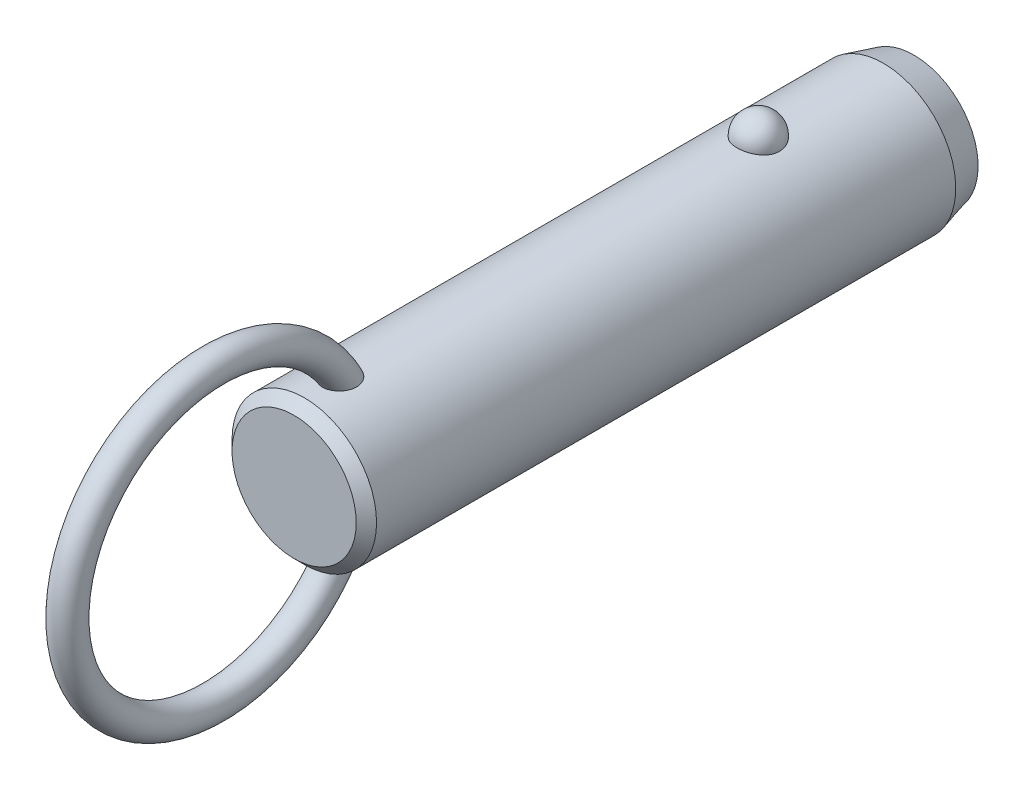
ISO-10303-21;
HEADER;
FILE_DESCRIPTION(('STEP AP214'),'2;1');
FILE_NAME('part.step','',(''),(''),'','','');
FILE_SCHEMA(('AUTOMOTIVE_DESIGN { 1 0 10303 214 1 1 1 1 }'));
ENDSEC;
DATA;
#1=APPLICATION_CONTEXT('core data for automotive mechanical design processes');
#2=APPLICATION_PROTOCOL_DEFINITION('international standard','automotive_design',2000,#1);
#3=PRODUCT_CONTEXT('',#1,'mechanical');
#4=PRODUCT('Part','Part','',(#3));
#5=PRODUCT_RELATED_PRODUCT_CATEGORY('part','',(#4));
#6=PRODUCT_DEFINITION_FORMATION('','',#4);
#7=PRODUCT_DEFINITION_CONTEXT('part definition',#1,'design');
#8=PRODUCT_DEFINITION('design','',#6,#7);
#9=PRODUCT_DEFINITION_SHAPE('','',#8);
#10=(LENGTH_UNIT() NAMED_UNIT(*) SI_UNIT(.MILLI.,.METRE.));
#11=(NAMED_UNIT(*) PLANE_ANGLE_UNIT() SI_UNIT($,.RADIAN.));
#12=(NAMED_UNIT(*) SI_UNIT($,.STERADIAN.) SOLID_ANGLE_UNIT());
#13=UNCERTAINTY_MEASURE_WITH_UNIT(LENGTH_MEASURE(1.E-05),#10,'distance_accuracy_value','');
#14=(GEOMETRIC_REPRESENTATION_CONTEXT(3) GLOBAL_UNCERTAINTY_ASSIGNED_CONTEXT((#13)) GLOBAL_UNIT_ASSIGNED_CONTEXT((#10,
#11,#12)) REPRESENTATION_CONTEXT('',''));
#15=CARTESIAN_POINT('',(0.,0.,0.));
#16=DIRECTION('',(0.,0.,1.));
#17=DIRECTION('',(1.,0.,0.));
#18=AXIS2_PLACEMENT_3D('',#15,#16,#17);
#19=CARTESIAN_POINT('',(0.,0.,35.6));
#20=DIRECTION('',(0.,0.,-1.));
#21=DIRECTION('',(-1.,0.,0.));
#22=AXIS2_PLACEMENT_3D('',#19,#20,#21);
#23=CYLINDRICAL_SURFACE('',#22,7.1);
#24=CARTESIAN_POINT('',(2.0769088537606,6.78943661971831,-2.1));
#25=CARTESIAN_POINT('',(2.07690739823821,6.78943796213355,-1.98268154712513));
#26=CARTESIAN_POINT('',(2.06738130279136,6.79237331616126,-1.86534506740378));
#27=CARTESIAN_POINT('',(2.0295040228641,6.8037853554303,-1.63400788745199));
#28=CARTESIAN_POINT('',(2.00114757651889,6.81226358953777,-1.52000812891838));
#29=CARTESIAN_POINT('',(1.92632025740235,6.83379798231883,-1.29863433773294));
#30=CARTESIAN_POINT('',(1.87985726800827,6.84685214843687,-1.19125744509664));
#31=CARTESIAN_POINT('',(1.76995205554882,6.87608091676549,-0.98604657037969));
#32=CARTESIAN_POINT('',(1.70650980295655,6.8922555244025,-0.88821260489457));
#33=CARTESIAN_POINT('',(1.5638119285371,6.92602930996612,-0.704242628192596));
#34=CARTESIAN_POINT('',(1.4844714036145,6.94363582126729,-0.618173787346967));
#35=CARTESIAN_POINT('',(1.31221746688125,6.97823658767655,-0.460740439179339));
#36=CARTESIAN_POINT('',(1.21930409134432,6.99523084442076,-0.389375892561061));
#37=CARTESIAN_POINT('',(1.02268781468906,7.02666176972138,-0.263547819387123));
#38=CARTESIAN_POINT('',(0.91902009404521,7.04110638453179,-0.209031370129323));
#39=CARTESIAN_POINT('',(0.703548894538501,7.06588726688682,-0.118163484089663));
#40=CARTESIAN_POINT('',(0.591746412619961,7.07622403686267,-0.0818098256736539));
#41=CARTESIAN_POINT('',(0.365557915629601,7.09147068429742,-0.0288711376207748));
#42=CARTESIAN_POINT('',(0.251267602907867,7.09648447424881,-0.0119070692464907));
#43=CARTESIAN_POINT('',(0.0213499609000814,7.10089837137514,0.00304925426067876));
#44=CARTESIAN_POINT('',(-0.0942772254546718,7.10029907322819,0.00104351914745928));
#45=CARTESIAN_POINT('',(-0.321651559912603,7.09360829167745,-0.0216931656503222));
#46=CARTESIAN_POINT('',(-0.433431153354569,7.08760388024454,-0.0421272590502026));
#47=CARTESIAN_POINT('',(-0.651862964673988,7.07086131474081,-0.100729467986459));
#48=CARTESIAN_POINT('',(-0.758515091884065,7.06012307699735,-0.138897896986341));
#49=CARTESIAN_POINT('',(-0.964449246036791,7.03496097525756,-0.232213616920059));
#50=CARTESIAN_POINT('',(-1.06368095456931,7.02051445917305,-0.287465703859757));
#51=CARTESIAN_POINT('',(-1.25145353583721,6.98948740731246,-0.413383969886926));
#52=CARTESIAN_POINT('',(-1.33999321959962,6.97290663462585,-0.48405186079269));
#53=CARTESIAN_POINT('',(-1.50591604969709,6.93898770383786,-0.640594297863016));
#54=CARTESIAN_POINT('',(-1.58302488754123,6.92164094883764,-0.726757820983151));
#55=CARTESIAN_POINT('',(-1.72189320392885,6.8884103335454,-0.91092752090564));
#56=CARTESIAN_POINT('',(-1.78365144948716,6.87252659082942,-1.008934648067));
#57=CARTESIAN_POINT('',(-1.89101272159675,6.84377189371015,-1.21549497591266));
#58=CARTESIAN_POINT('',(-1.93639553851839,6.83094274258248,-1.32416860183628));
#59=CARTESIAN_POINT('',(-2.00874275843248,6.81002070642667,-1.54791500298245));
#60=CARTESIAN_POINT('',(-2.03570774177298,6.80192767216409,-1.66298757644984));
#61=CARTESIAN_POINT('',(-2.07047276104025,6.7914266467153,-1.89571453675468));
#62=CARTESIAN_POINT('',(-2.07835878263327,6.78899315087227,-2.01335491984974));
#63=CARTESIAN_POINT('',(-2.07502083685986,6.79001409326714,-2.24833570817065));
#64=CARTESIAN_POINT('',(-2.06379746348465,6.7934683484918,-2.36567612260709));
#65=CARTESIAN_POINT('',(-2.02263913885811,6.80583442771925,-2.59603194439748));
#66=CARTESIAN_POINT('',(-1.99281127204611,6.81471501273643,-2.70906820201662));
#67=CARTESIAN_POINT('',(-1.91526639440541,6.83691232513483,-2.92836575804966));
#68=CARTESIAN_POINT('',(-1.8675486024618,6.85022924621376,-3.03462676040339));
#69=CARTESIAN_POINT('',(-1.75504492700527,6.87991336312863,-3.23806487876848));
#70=CARTESIAN_POINT('',(-1.69015924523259,6.89629822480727,-3.33518422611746));
#71=CARTESIAN_POINT('',(-1.54505404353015,6.93024852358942,-3.51697105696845));
#72=CARTESIAN_POINT('',(-1.46483385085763,6.94781401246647,-3.60163799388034));
#73=CARTESIAN_POINT('',(-1.29071406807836,6.98225977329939,-3.75654119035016));
#74=CARTESIAN_POINT('',(-1.19675650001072,6.99913673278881,-3.82671308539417));
#75=CARTESIAN_POINT('',(-0.997940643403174,7.03023618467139,-3.9501837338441));
#76=CARTESIAN_POINT('',(-0.89308318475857,7.04445887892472,-4.00348377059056));
#77=CARTESIAN_POINT('',(-0.676902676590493,7.06848365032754,-4.09107242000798));
#78=CARTESIAN_POINT('',(-0.565686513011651,7.0783430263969,-4.12560889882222));
#79=CARTESIAN_POINT('',(-0.338739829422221,7.09282534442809,-4.17575450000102));
#80=CARTESIAN_POINT('',(-0.223009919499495,7.09744899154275,-4.19136617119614));
#81=CARTESIAN_POINT('',(0.00707628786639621,7.10090930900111,-4.20307965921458));
#82=CARTESIAN_POINT('',(0.121410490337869,7.09986531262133,-4.19958377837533));
#83=CARTESIAN_POINT('',(0.347815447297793,7.092380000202,-4.17411564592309));
#84=CARTESIAN_POINT('',(0.459886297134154,7.08593891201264,-4.15214417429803));
#85=CARTESIAN_POINT('',(0.678084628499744,7.06838983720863,-4.09049562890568));
#86=CARTESIAN_POINT('',(0.784237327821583,7.05730369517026,-4.05090137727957));
#87=CARTESIAN_POINT('',(0.988305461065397,7.03163139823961,-3.95511447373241));
#88=CARTESIAN_POINT('',(1.08622031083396,7.01704499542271,-3.89892064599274));
#89=CARTESIAN_POINT('',(1.27284490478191,6.98562668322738,-3.77035541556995));
#90=CARTESIAN_POINT('',(1.36137372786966,6.96876135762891,-3.69772964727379));
#91=CARTESIAN_POINT('',(1.52509486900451,6.93477412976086,-3.53878279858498));
#92=CARTESIAN_POINT('',(1.60028496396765,6.91765218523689,-3.45245943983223));
#93=CARTESIAN_POINT('',(1.73681688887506,6.88465753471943,-3.26658774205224));
#94=CARTESIAN_POINT('',(1.79785966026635,6.86881574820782,-3.16681408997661));
#95=CARTESIAN_POINT('',(1.90265327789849,6.84053157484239,-2.95814408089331));
#96=CARTESIAN_POINT('',(1.94640861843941,6.82808830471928,-2.84925010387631));
#97=CARTESIAN_POINT('',(2.01274378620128,6.80881460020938,-2.63454318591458));
#98=CARTESIAN_POINT('',(2.03676193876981,6.80160856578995,-2.52920574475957));
#99=CARTESIAN_POINT('',(2.06884490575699,6.79191902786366,-2.3159172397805));
#100=CARTESIAN_POINT('',(2.07691019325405,6.78943538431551,-2.20796625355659));
#101=CARTESIAN_POINT('',(2.0769088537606,6.78943661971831,-2.1));
#102=B_SPLINE_CURVE_WITH_KNOTS('',3,(#24,#25,#26,#27,#28,#29,#30,#31,#32,#33,#34,#35,#36,#37,
#38,#39,#40,#41,#42,#43,#44,#45,#46,#47,#48,#49,#50,#51,#52,#53,#54,#55,#56,#57,#58,#59,#60,#61,
#62,#63,#64,#65,#66,#67,#68,#69,#70,#71,#72,#73,#74,#75,#76,#77,#78,#79,#80,#81,#82,#83,#84,#85,
#86,#87,#88,#89,#90,#91,#92,#93,#94,#95,#96,#97,#98,#99,#100,#101),.UNSPECIFIED.,.T.,.F.,(4,2,2,
2,2,2,2,2,2,2,2,2,2,2,2,2,2,2,2,2,2,2,2,2,2,2,2,2,2,2,2,2,2,2,2,2,2,2,4),(0.,0.351568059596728,
0.703234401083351,1.05474780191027,1.40626181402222,1.75970563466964,2.11314851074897,
2.4654696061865,2.81774759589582,3.16301449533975,3.50824481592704,3.84801136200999,
4.18778391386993,4.52968352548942,4.87162112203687,5.22076181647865,5.56993054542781,
5.92363364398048,6.27732559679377,6.62942052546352,6.98150450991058,7.33158042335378,
7.68167162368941,8.03384443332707,8.38603269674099,8.73975272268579,9.09344583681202,
9.44234545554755,9.79119807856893,10.1327344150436,10.4742563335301,10.8141898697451,
11.1541474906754,11.4997793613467,11.8454687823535,12.1979079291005,12.5502553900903,
12.8738073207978,13.1973496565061),.UNSPECIFIED.);
#103=CARTESIAN_POINT('',(2.0769088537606,6.78943661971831,-2.1));
#104=VERTEX_POINT('',#103);
#105=EDGE_CURVE('E41',#104,#104,#102,.T.);
#106=ORIENTED_EDGE('',*,*,#105,.T.);
#107=EDGE_LOOP('',(#106));
#108=FACE_BOUND('',#107,.T.);
#109=CARTESIAN_POINT('',(0.,0.,42.52));
#110=DIRECTION('',(0.,0.,1.));
#111=DIRECTION('',(1.,0.,0.));
#112=AXIS2_PLACEMENT_3D('',#109,#110,#111);
#113=CIRCLE('',#112,7.1);
#114=CARTESIAN_POINT('',(7.1,0.,42.52));
#115=VERTEX_POINT('',#114);
#116=EDGE_CURVE('E10',#115,#115,#113,.F.);
#117=ORIENTED_EDGE('',*,*,#116,.T.);
#118=EDGE_LOOP('',(#117));
#119=FACE_BOUND('',#118,.T.);
#120=CARTESIAN_POINT('',(-0.429539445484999,-7.08699541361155,37.3429212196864));
#121=CARTESIAN_POINT('',(-0.50833166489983,-7.08221999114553,37.3668764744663));
#122=CARTESIAN_POINT('',(-0.585039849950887,-7.07624016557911,37.3974570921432));
#123=CARTESIAN_POINT('',(-0.732082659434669,-7.06254296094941,37.4710242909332));
#124=CARTESIAN_POINT('',(-0.802417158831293,-7.05482554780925,37.5140111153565));
#125=CARTESIAN_POINT('',(-0.934722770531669,-7.03851844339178,37.6111135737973));
#126=CARTESIAN_POINT('',(-0.996700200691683,-7.02992941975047,37.6652207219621));
#127=CARTESIAN_POINT('',(-1.11079942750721,-7.01280697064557,37.7829676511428));
#128=CARTESIAN_POINT('',(-1.16292136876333,-7.00427354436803,37.8466072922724));
#129=CARTESIAN_POINT('',(-1.25705660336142,-6.98799959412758,37.9826870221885));
#130=CARTESIAN_POINT('',(-1.29888032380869,-6.98027525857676,38.0552598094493));
#131=CARTESIAN_POINT('',(-1.37069920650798,-6.96652886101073,38.2061686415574));
#132=CARTESIAN_POINT('',(-1.40069157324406,-6.96050720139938,38.2845060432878));
#133=CARTESIAN_POINT('',(-1.45043507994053,-6.95031881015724,38.4501903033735));
#134=CARTESIAN_POINT('',(-1.46937115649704,-6.94630231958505,38.5377897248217));
#135=CARTESIAN_POINT('',(-1.49424917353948,-6.94099239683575,38.7148714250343));
#136=CARTESIAN_POINT('',(-1.50018601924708,-6.93970003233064,38.8043544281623));
#137=CARTESIAN_POINT('',(-1.49978214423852,-6.93978815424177,38.9940607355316));
#138=CARTESIAN_POINT('',(-1.49187639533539,-6.94150934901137,39.094279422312));
#139=CARTESIAN_POINT('',(-1.46177925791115,-6.94790814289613,39.2924798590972));
#140=CARTESIAN_POINT('',(-1.43957541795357,-6.95258831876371,39.390459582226));
#141=CARTESIAN_POINT('',(-1.37783293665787,-6.96510647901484,39.5953629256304));
#142=CARTESIAN_POINT('',(-1.33634073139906,-6.97328848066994,39.7016801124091));
#143=CARTESIAN_POINT('',(-1.23686994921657,-6.99161706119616,39.9061777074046));
#144=CARTESIAN_POINT('',(-1.17889192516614,-7.00176357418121,40.0043583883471));
#145=CARTESIAN_POINT('',(-1.05875124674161,-7.02082898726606,40.172374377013));
#146=CARTESIAN_POINT('',(-0.999247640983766,-7.02963746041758,40.2441230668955));
#147=CARTESIAN_POINT('',(-0.869494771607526,-7.04686074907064,40.3771959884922));
#148=CARTESIAN_POINT('',(-0.799263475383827,-7.05527619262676,40.4385372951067));
#149=CARTESIAN_POINT('',(-0.665408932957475,-7.06899457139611,40.5351316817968));
#150=CARTESIAN_POINT('',(-0.603817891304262,-7.07457275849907,40.5731512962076));
#151=CARTESIAN_POINT('',(-0.475172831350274,-7.08437420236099,40.6387581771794));
#152=CARTESIAN_POINT('',(-0.408123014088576,-7.08859848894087,40.6663533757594));
#153=CARTESIAN_POINT('',(-0.269431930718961,-7.09522749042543,40.7092569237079));
#154=CARTESIAN_POINT('',(-0.197757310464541,-7.09761688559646,40.7244618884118));
#155=CARTESIAN_POINT('',(-0.052784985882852,-7.10017268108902,40.7407168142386));
#156=CARTESIAN_POINT('',(0.0205115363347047,-7.10034065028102,40.7417767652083));
#157=CARTESIAN_POINT('',(0.156426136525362,-7.09855986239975,40.7304619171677));
#158=CARTESIAN_POINT('',(0.219199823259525,-7.09688191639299,40.7198060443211));
#159=CARTESIAN_POINT('',(0.342134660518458,-7.09201880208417,40.6885379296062));
#160=CARTESIAN_POINT('',(0.402295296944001,-7.08883333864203,40.6679237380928));
#161=CARTESIAN_POINT('',(0.520687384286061,-7.08113868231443,40.6172125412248));
#162=CARTESIAN_POINT('',(0.57879126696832,-7.07658958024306,40.5868272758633));
#163=CARTESIAN_POINT('',(0.690173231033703,-7.06659708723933,40.5183678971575));
#164=CARTESIAN_POINT('',(0.743447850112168,-7.061153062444,40.4802883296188));
#165=CARTESIAN_POINT('',(0.870947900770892,-7.04680292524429,40.3765929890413));
#166=CARTESIAN_POINT('',(0.941828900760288,-7.0375580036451,40.3068972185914));
#167=CARTESIAN_POINT('',(1.07136606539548,-7.01900793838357,40.1569450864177));
#168=CARTESIAN_POINT('',(1.13000013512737,-7.00970271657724,40.0766700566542));
#169=CARTESIAN_POINT('',(1.23579584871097,-6.99183327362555,39.9068997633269));
#170=CARTESIAN_POINT('',(1.28274271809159,-6.98328455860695,39.8172696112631));
#171=CARTESIAN_POINT('',(1.36351442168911,-6.96796352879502,39.6321763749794));
#172=CARTESIAN_POINT('',(1.39733971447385,-6.96119115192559,39.5367134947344));
#173=CARTESIAN_POINT('',(1.45579181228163,-6.94922464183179,39.3253092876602));
#174=CARTESIAN_POINT('',(1.47790145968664,-6.94449000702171,39.208631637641));
#175=CARTESIAN_POINT('',(1.50168752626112,-6.93938731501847,38.9730153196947));
#176=CARTESIAN_POINT('',(1.50336085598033,-6.93901991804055,38.8540763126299));
#177=CARTESIAN_POINT('',(1.48486516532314,-6.9430010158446,38.6236079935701));
#178=CARTESIAN_POINT('',(1.46573441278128,-6.9471253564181,38.5119958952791));
#179=CARTESIAN_POINT('',(1.40606892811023,-6.95944667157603,38.2948868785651));
#180=CARTESIAN_POINT('',(1.3655644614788,-6.96763788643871,38.1893815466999));
#181=CARTESIAN_POINT('',(1.27082700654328,-6.98548038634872,38.0042879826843));
#182=CARTESIAN_POINT('',(1.21949810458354,-6.99473841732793,37.9231719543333));
#183=CARTESIAN_POINT('',(1.10242050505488,-7.01414069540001,37.7722278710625));
#184=CARTESIAN_POINT('',(1.03668119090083,-7.02428436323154,37.7023925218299));
#185=CARTESIAN_POINT('',(0.900559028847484,-7.04295285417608,37.5835735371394));
#186=CARTESIAN_POINT('',(0.831428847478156,-7.05153466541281,37.5331573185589));
#187=CARTESIAN_POINT('',(0.685291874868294,-7.06723150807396,37.4451429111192));
#188=CARTESIAN_POINT('',(0.608287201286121,-7.0743469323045,37.4075412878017));
#189=CARTESIAN_POINT('',(0.451878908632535,-7.08602232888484,37.3474915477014));
#190=CARTESIAN_POINT('',(0.372686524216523,-7.09067127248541,37.3245088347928));
#191=CARTESIAN_POINT('',(0.211477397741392,-7.09730788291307,37.2920357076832));
#192=CARTESIAN_POINT('',(0.129460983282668,-7.09929585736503,37.2825437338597));
#193=CARTESIAN_POINT('',(-0.0332905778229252,-7.10037858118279,37.2773517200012));
#194=CARTESIAN_POINT('',(-0.114016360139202,-7.09953334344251,37.2813656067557));
#195=CARTESIAN_POINT('',(-0.273670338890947,-7.09517338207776,37.3024540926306));
#196=CARTESIAN_POINT('',(-0.352598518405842,-7.09165863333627,37.3195288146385));
#197=CARTESIAN_POINT('',(-0.429539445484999,-7.08699541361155,37.3429212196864));
#198=B_SPLINE_CURVE_WITH_KNOTS('',3,(#120,#121,#122,#123,#124,#125,#126,#127,#128,#129,#130,
#131,#132,#133,#134,#135,#136,#137,#138,#139,#140,#141,#142,#143,#144,#145,#146,#147,#148,#149,
#150,#151,#152,#153,#154,#155,#156,#157,#158,#159,#160,#161,#162,#163,#164,#165,#166,#167,#168,
#169,#170,#171,#172,#173,#174,#175,#176,#177,#178,#179,#180,#181,#182,#183,#184,#185,#186,#187,
#188,#189,#190,#191,#192,#193,#194,#195,#196,#197),.UNSPECIFIED.,.T.,.F.,(4,2,2,2,2,2,2,2,2,2,2,
2,2,2,2,2,2,2,2,2,2,2,2,2,2,2,2,2,2,2,2,2,2,2,2,2,2,2,4),(0.,0.247183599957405,
0.494372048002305,0.741372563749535,0.988369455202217,1.23962059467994,1.49093106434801,
1.75897818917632,2.02713035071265,2.32758265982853,2.62829697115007,2.9700873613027,
3.31186629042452,3.59175319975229,3.87117637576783,4.08813841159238,4.30493502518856,
4.52352259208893,4.74195577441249,4.93215328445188,5.12238804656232,5.31884850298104,
5.51544871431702,5.81332317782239,6.11173048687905,6.41527266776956,6.71880423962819,
7.07358156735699,7.42841252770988,7.76631485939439,8.10373999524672,8.39142246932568,
8.67891817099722,8.93560332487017,9.19221962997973,9.43881106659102,9.68537399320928,
9.92674752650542,10.1681233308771),.UNSPECIFIED.);
#199=CARTESIAN_POINT('',(-0.429539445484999,-7.08699541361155,37.3429212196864));
#200=VERTEX_POINT('',#199);
#201=EDGE_CURVE('E60',#200,#200,#198,.T.);
#202=ORIENTED_EDGE('',*,*,#201,.T.);
#203=EDGE_LOOP('',(#202));
#204=FACE_BOUND('',#203,.T.);
#205=CARTESIAN_POINT('',(-0.429539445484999,7.08699541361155,37.3429212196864));
#206=CARTESIAN_POINT('',(-0.351665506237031,7.09171429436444,37.3192469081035));
#207=CARTESIAN_POINT('',(-0.271733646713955,7.09525896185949,37.3020369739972));
#208=CARTESIAN_POINT('',(-0.110026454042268,7.09960839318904,37.2810059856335));
#209=CARTESIAN_POINT('',(-0.0282502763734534,7.10041187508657,37.277191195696));
#210=CARTESIAN_POINT('',(0.134782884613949,7.09918849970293,37.283059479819));
#211=CARTESIAN_POINT('',(0.216039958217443,7.09716214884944,37.2927401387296));
#212=CARTESIAN_POINT('',(0.375730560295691,7.09050177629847,37.3253471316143));
#213=CARTESIAN_POINT('',(0.454164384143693,7.08586802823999,37.3482720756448));
#214=CARTESIAN_POINT('',(0.606025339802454,7.07449911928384,37.406771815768));
#215=CARTESIAN_POINT('',(0.679451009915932,7.06776334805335,37.4423502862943));
#216=CARTESIAN_POINT('',(0.819234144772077,7.05292866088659,37.5251753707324));
#217=CARTESIAN_POINT('',(0.88559181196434,7.04482978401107,37.5724216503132));
#218=CARTESIAN_POINT('',(1.00993211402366,7.02808709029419,37.6775902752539));
#219=CARTESIAN_POINT('',(1.06785399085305,7.01943990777,37.735583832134));
#220=CARTESIAN_POINT('',(1.17342527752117,7.00256662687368,37.8603013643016));
#221=CARTESIAN_POINT('',(1.22107408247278,6.99434055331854,37.9270258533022));
#222=CARTESIAN_POINT('',(1.30652927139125,6.97889183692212,38.0693622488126));
#223=CARTESIAN_POINT('',(1.34399711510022,6.97170674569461,38.1451808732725));
#224=CARTESIAN_POINT('',(1.40682616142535,6.95930080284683,38.3018100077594));
#225=CARTESIAN_POINT('',(1.43218374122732,6.95408053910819,38.3826220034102));
#226=CARTESIAN_POINT('',(1.47246409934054,6.94566853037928,38.5535314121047));
#227=CARTESIAN_POINT('',(1.48642590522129,6.9426653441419,38.6438630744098));
#228=CARTESIAN_POINT('',(1.5011410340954,6.93949744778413,38.825619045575));
#229=CARTESIAN_POINT('',(1.50188917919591,6.93933385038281,38.9170437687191));
#230=CARTESIAN_POINT('',(1.49030464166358,6.94183245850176,39.1108438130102));
#231=CARTESIAN_POINT('',(1.47627413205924,6.94486147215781,39.213112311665));
#232=CARTESIAN_POINT('',(1.43356351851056,6.95380194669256,39.4144719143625));
#233=CARTESIAN_POINT('',(1.4048676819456,6.95971650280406,39.5135594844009));
#234=CARTESIAN_POINT('',(1.32908750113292,6.97461208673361,39.7189087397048));
#235=CARTESIAN_POINT('',(1.28011435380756,6.98388945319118,39.8244566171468));
#236=CARTESIAN_POINT('',(1.16520357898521,7.00397743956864,40.0257604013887));
#237=CARTESIAN_POINT('',(1.09927694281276,7.01478706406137,40.1215225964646));
#238=CARTESIAN_POINT('',(0.969361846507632,7.03373936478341,40.2767565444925));
#239=CARTESIAN_POINT('',(0.909042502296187,7.04187023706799,40.3393032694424));
#240=CARTESIAN_POINT('',(0.779178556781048,7.05741732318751,40.4540535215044));
#241=CARTESIAN_POINT('',(0.709649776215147,7.06483472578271,40.5062744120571));
#242=CARTESIAN_POINT('',(0.576854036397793,7.0767751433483,40.5881138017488));
#243=CARTESIAN_POINT('',(0.515118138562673,7.08158033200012,40.6201641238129));
#244=CARTESIAN_POINT('',(0.387127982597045,7.08972701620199,40.6737656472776));
#245=CARTESIAN_POINT('',(0.320877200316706,7.09306962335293,40.6953248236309));
#246=CARTESIAN_POINT('',(0.185041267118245,7.09791507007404,40.7264005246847));
#247=CARTESIAN_POINT('',(0.115437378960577,7.09940591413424,40.7358385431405));
#248=CARTESIAN_POINT('',(-0.0243157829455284,7.10030171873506,40.7415226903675));
#249=CARTESIAN_POINT('',(-0.0944648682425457,7.0997073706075,40.7377731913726));
#250=CARTESIAN_POINT('',(-0.225713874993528,7.09668414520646,40.7185081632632));
#251=CARTESIAN_POINT('',(-0.287006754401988,7.09444865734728,40.7042323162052));
#252=CARTESIAN_POINT('',(-0.406555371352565,7.08860360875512,40.6663685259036));
#253=CARTESIAN_POINT('',(-0.464809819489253,7.08499346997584,40.6427766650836));
#254=CARTESIAN_POINT('',(-0.594955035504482,7.07541654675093,40.5789232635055));
#255=CARTESIAN_POINT('',(-0.665389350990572,7.06906574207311,40.535753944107));
#256=CARTESIAN_POINT('',(-0.798242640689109,7.05530261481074,40.438587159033));
#257=CARTESIAN_POINT('',(-0.860645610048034,7.0478882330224,40.3845686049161));
#258=CARTESIAN_POINT('',(-0.994249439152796,7.03045217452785,40.2509965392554));
#259=CARTESIAN_POINT('',(-1.06260129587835,7.02030745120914,40.1686143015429));
#260=CARTESIAN_POINT('',(-1.18502045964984,7.00068382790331,39.993843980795));
#261=CARTESIAN_POINT('',(-1.23907684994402,6.99120544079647,39.901448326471));
#262=CARTESIAN_POINT('',(-1.33335589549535,6.97384343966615,39.7080085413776));
#263=CARTESIAN_POINT('',(-1.37336138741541,6.96598557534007,39.6068564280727));
#264=CARTESIAN_POINT('',(-1.43770677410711,6.9529905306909,39.3995046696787));
#265=CARTESIAN_POINT('',(-1.46204473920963,6.94785368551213,39.29330440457));
#266=CARTESIAN_POINT('',(-1.49537533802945,6.94076296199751,39.0682317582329));
#267=CARTESIAN_POINT('',(-1.50273564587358,6.93914842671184,38.9490975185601));
#268=CARTESIAN_POINT('',(-1.4954555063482,6.94072368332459,38.7114703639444));
#269=CARTESIAN_POINT('',(-1.48082914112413,6.94391040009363,38.5929770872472));
#270=CARTESIAN_POINT('',(-1.43076401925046,6.95438579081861,38.3734325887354));
#271=CARTESIAN_POINT('',(-1.39762227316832,6.96121852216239,38.2718413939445));
#272=CARTESIAN_POINT('',(-1.31211274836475,6.97783941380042,38.0773513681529));
#273=CARTESIAN_POINT('',(-1.25976607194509,6.98762432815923,37.9844431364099));
#274=CARTESIAN_POINT('',(-1.14583073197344,7.00713153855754,37.8241601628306));
#275=CARTESIAN_POINT('',(-1.08665947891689,7.01665982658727,37.7550351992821));
#276=CARTESIAN_POINT('',(-0.95660664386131,7.03556646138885,37.6288786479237));
#277=CARTESIAN_POINT('',(-0.885737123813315,7.04494495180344,37.5718347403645));
#278=CARTESIAN_POINT('',(-0.75155804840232,7.06035735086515,37.4831004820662));
#279=CARTESIAN_POINT('',(-0.690120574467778,7.0666695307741,37.4485932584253));
#280=CARTESIAN_POINT('',(-0.562815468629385,7.07794609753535,37.3887507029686));
#281=CARTESIAN_POINT('',(-0.496948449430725,7.08291067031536,37.3634141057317));
#282=CARTESIAN_POINT('',(-0.429539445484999,7.08699541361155,37.3429212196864));
#283=B_SPLINE_CURVE_WITH_KNOTS('',3,(#205,#206,#207,#208,#209,#210,#211,#212,#213,#214,#215,
#216,#217,#218,#219,#220,#221,#222,#223,#224,#225,#226,#227,#228,#229,#230,#231,#232,#233,#234,
#235,#236,#237,#238,#239,#240,#241,#242,#243,#244,#245,#246,#247,#248,#249,#250,#251,#252,#253,
#254,#255,#256,#257,#258,#259,#260,#261,#262,#263,#264,#265,#266,#267,#268,#269,#270,#271,#272,
#273,#274,#275,#276,#277,#278,#279,#280,#281,#282),.UNSPECIFIED.,.T.,.F.,(4,2,2,2,2,2,2,2,2,2,2,
2,2,2,2,2,2,2,2,2,2,2,2,2,2,2,2,2,2,2,2,2,2,2,2,2,2,2,4),(0.,0.244335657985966,
0.488785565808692,0.733191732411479,0.977572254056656,1.22202379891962,1.46646834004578,
1.71259457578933,1.9587352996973,2.21226768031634,2.46587585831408,2.7391381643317,
3.01250754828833,3.32109936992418,3.63002293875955,3.9786351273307,4.32702187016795,
4.58793945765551,4.84841449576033,5.05676704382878,5.26496096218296,5.47449661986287,
5.68396281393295,5.87205447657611,6.06022532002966,6.30743751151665,6.55513496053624,
6.87602468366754,7.19715875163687,7.52305774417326,7.84899686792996,8.20516155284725,
8.56109821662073,8.88040084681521,9.19935367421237,9.4723628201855,9.74509220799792,
9.95662250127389,10.1681235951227),.UNSPECIFIED.);
#284=CARTESIAN_POINT('',(-0.429539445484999,7.08699541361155,37.3429212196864));
#285=VERTEX_POINT('',#284);
#286=EDGE_CURVE('E68',#285,#285,#283,.T.);
#287=ORIENTED_EDGE('',*,*,#286,.T.);
#288=EDGE_LOOP('',(#287));
#289=FACE_BOUND('',#288,.T.);
#290=CARTESIAN_POINT('',(0.,0.,-14.4));
#291=DIRECTION('',(0.,0.,-1.));
#292=DIRECTION('',(-1.,0.,0.));
#293=AXIS2_PLACEMENT_3D('',#290,#291,#292);
#294=CIRCLE('',#293,7.1);
#295=CARTESIAN_POINT('',(-7.1,0.,-14.4));
#296=VERTEX_POINT('',#295);
#297=EDGE_CURVE('E57',#296,#296,#294,.F.);
#298=ORIENTED_EDGE('',*,*,#297,.T.);
#299=EDGE_LOOP('',(#298));
#300=FACE_BOUND('',#299,.T.);
#301=ADVANCED_FACE('F37',(#108,#119,#204,#289,#300),#23,.T.);
#302=CARTESIAN_POINT('',(0.,0.,-17.4));
#303=DIRECTION('',(0.,0.,-1.));
#304=DIRECTION('',(-1.,0.,0.));
#305=AXIS2_PLACEMENT_3D('',#302,#303,#304);
#306=PLANE('',#305);
#307=CARTESIAN_POINT('',(0.,0.,-17.4));
#308=DIRECTION('',(0.,0.,-1.));
#309=DIRECTION('',(-1.,0.,0.));
#310=AXIS2_PLACEMENT_3D('',#307,#308,#309);
#311=CIRCLE('',#310,6.29615242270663);
#312=CARTESIAN_POINT('',(-6.29615242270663,0.,-17.4));
#313=VERTEX_POINT('',#312);
#314=EDGE_CURVE('E67',#313,#313,#311,.T.);
#315=ORIENTED_EDGE('',*,*,#314,.T.);
#316=EDGE_LOOP('',(#315));
#317=FACE_BOUND('',#316,.T.);
#318=ADVANCED_FACE('F86',(#317),#306,.T.);
#319=CARTESIAN_POINT('',(0.,0.,-17.4));
#320=DIRECTION('',(0.,0.,1.));
#321=DIRECTION('',(1.,0.,0.));
#322=AXIS2_PLACEMENT_3D('',#319,#320,#321);
#323=CONICAL_SURFACE('',#322,6.29615242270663,0.261799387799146);
#324=ORIENTED_EDGE('',*,*,#297,.F.);
#325=EDGE_LOOP('',(#324));
#326=FACE_BOUND('',#325,.T.);
#327=ORIENTED_EDGE('',*,*,#314,.F.);
#328=EDGE_LOOP('',(#327));
#329=FACE_BOUND('',#328,.T.);
#330=ADVANCED_FACE('F84',(#326,#329),#323,.T.);
#331=CARTESIAN_POINT('',(0.,0.,43.52));
#332=DIRECTION('',(0.,0.,1.));
#333=DIRECTION('',(1.,0.,0.));
#334=AXIS2_PLACEMENT_3D('',#331,#332,#333);
#335=PLANE('',#334);
#336=CARTESIAN_POINT('',(0.,0.,43.52));
#337=DIRECTION('',(0.,0.,1.));
#338=DIRECTION('',(1.,0.,0.));
#339=AXIS2_PLACEMENT_3D('',#336,#337,#338);
#340=CIRCLE('',#339,6.10000000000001);
#341=CARTESIAN_POINT('',(6.10000000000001,0.,43.52));
#342=VERTEX_POINT('',#341);
#343=EDGE_CURVE('E50',#342,#342,#340,.T.);
#344=ORIENTED_EDGE('',*,*,#343,.T.);
#345=EDGE_LOOP('',(#344));
#346=FACE_BOUND('',#345,.T.);
#347=ADVANCED_FACE('F78',(#346),#335,.T.);
#348=CARTESIAN_POINT('',(0.,0.,51.45));
#349=DIRECTION('',(1.,0.,0.));
#350=DIRECTION('',(0.,0.,-1.));
#351=AXIS2_PLACEMENT_3D('',#348,#349,#350);
#352=TOROIDAL_SURFACE('',#351,14.35,1.5);
#353=ORIENTED_EDGE('',*,*,#286,.F.);
#354=EDGE_LOOP('',(#353));
#355=FACE_BOUND('',#354,.T.);
#356=ORIENTED_EDGE('',*,*,#201,.F.);
#357=EDGE_LOOP('',(#356));
#358=FACE_BOUND('',#357,.T.);
#359=ADVANCED_FACE('F74',(#355,#358),#352,.T.);
#360=CARTESIAN_POINT('',(0.,0.,43.52));
#361=DIRECTION('',(0.,0.,-1.));
#362=DIRECTION('',(-1.,0.,0.));
#363=AXIS2_PLACEMENT_3D('',#360,#361,#362);
#364=CONICAL_SURFACE('',#363,6.10000000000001,0.785398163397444);
#365=ORIENTED_EDGE('',*,*,#116,.F.);
#366=EDGE_LOOP('',(#365));
#367=FACE_BOUND('',#366,.T.);
#368=ORIENTED_EDGE('',*,*,#343,.F.);
#369=EDGE_LOOP('',(#368));
#370=FACE_BOUND('',#369,.T.);
#371=ADVANCED_FACE('F39',(#367,#370),#364,.T.);
#372=CARTESIAN_POINT('',(0.,7.1,-2.1));
#373=DIRECTION('',(0.,1.,0.));
#374=DIRECTION('',(0.,0.,1.));
#375=AXIS2_PLACEMENT_3D('',#372,#373,#374);
#376=SPHERICAL_SURFACE('',#375,2.10000000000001);
#377=ORIENTED_EDGE('',*,*,#105,.F.);
#378=EDGE_LOOP('',(#377));
#379=FACE_BOUND('',#378,.T.);
#380=ADVANCED_FACE('F80',(#379),#376,.T.);
#381=CLOSED_SHELL('',(#301,#318,#330,#347,#359,#371,#380));
#382=MANIFOLD_SOLID_BREP('B2',#381);
#383=ADVANCED_BREP_SHAPE_REPRESENTATION('',(#18,#382),#14);
#384=SHAPE_DEFINITION_REPRESENTATION(#9,#383);
ENDSEC;
END-ISO-10303-21;
